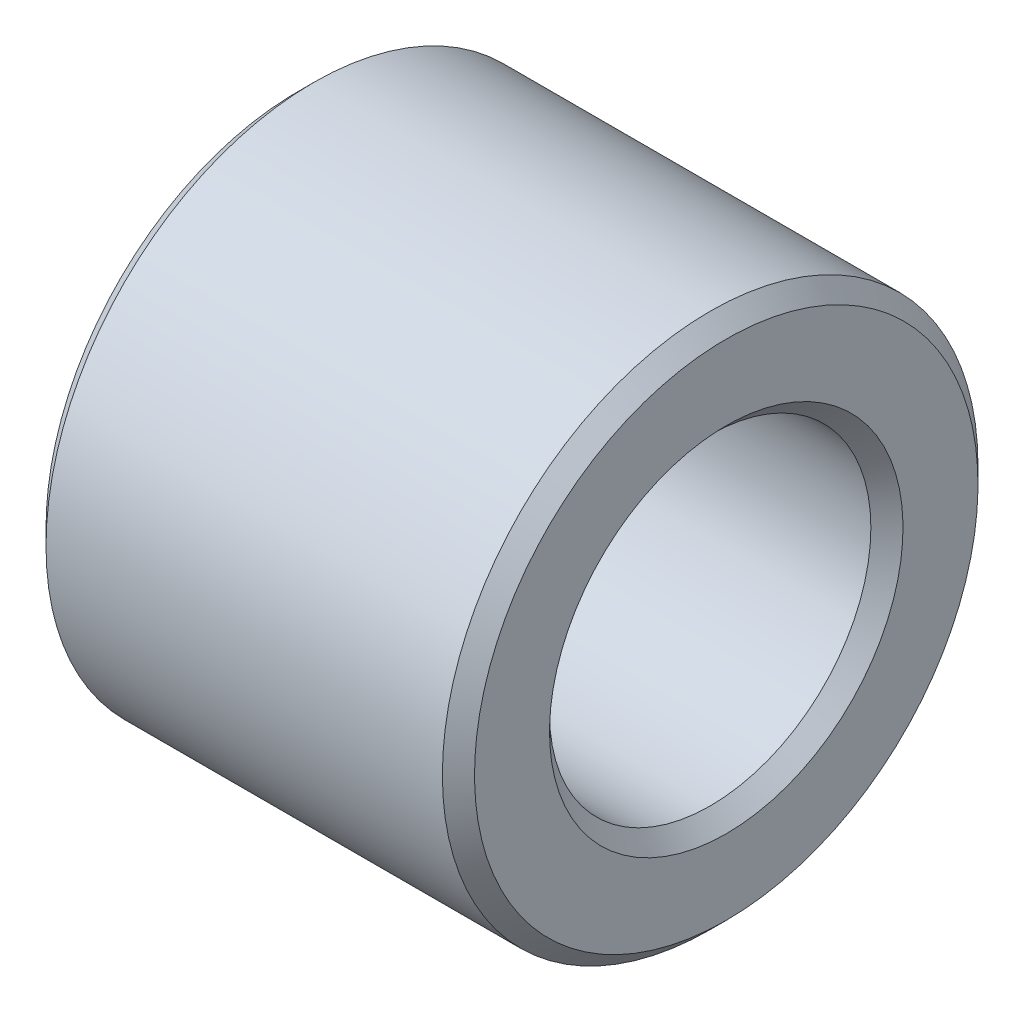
from build123d import *


with BuildPart() as part:
    # Esquisse1 → Base-R_volution (revolve)
    with BuildSketch(Plane.XY, mode=Mode.PRIVATE) as base_r_volution_sk:
        Polygon((0, 3.3), (0, 4.7), (0.3, 5), (7.7, 5), (8, 4.7), (8, 3.3), (7.7, 3), (0.3, 3), align=None)
    revolve(base_r_volution_sk.sketch.rotate(Axis((0, 0, 0), (1, 0, 0)), 180), axis=Axis((0, 0, 0), (1, 0, 0)))


solid = part.part
